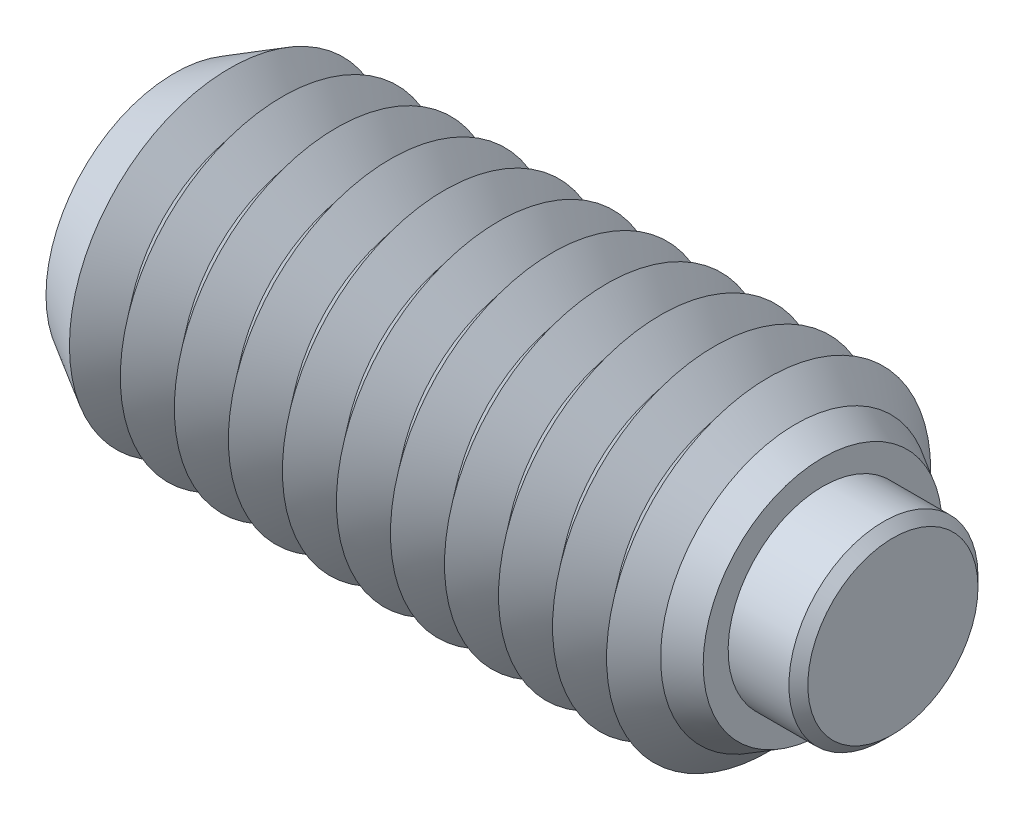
ISO-10303-21;
HEADER;
FILE_DESCRIPTION(('STEP AP214'),'2;1');
FILE_NAME('part.step','',(''),(''),'','','');
FILE_SCHEMA(('AUTOMOTIVE_DESIGN { 1 0 10303 214 1 1 1 1 }'));
ENDSEC;
DATA;
#1=APPLICATION_CONTEXT('core data for automotive mechanical design processes');
#2=APPLICATION_PROTOCOL_DEFINITION('international standard','automotive_design',2000,#1);
#3=PRODUCT_CONTEXT('',#1,'mechanical');
#4=PRODUCT('Part','Part','',(#3));
#5=PRODUCT_RELATED_PRODUCT_CATEGORY('part','',(#4));
#6=PRODUCT_DEFINITION_FORMATION('','',#4);
#7=PRODUCT_DEFINITION_CONTEXT('part definition',#1,'design');
#8=PRODUCT_DEFINITION('design','',#6,#7);
#9=PRODUCT_DEFINITION_SHAPE('','',#8);
#10=(LENGTH_UNIT() NAMED_UNIT(*) SI_UNIT(.MILLI.,.METRE.));
#11=(NAMED_UNIT(*) PLANE_ANGLE_UNIT() SI_UNIT($,.RADIAN.));
#12=(NAMED_UNIT(*) SI_UNIT($,.STERADIAN.) SOLID_ANGLE_UNIT());
#13=UNCERTAINTY_MEASURE_WITH_UNIT(LENGTH_MEASURE(1.E-05),#10,'distance_accuracy_value','');
#14=(GEOMETRIC_REPRESENTATION_CONTEXT(3) GLOBAL_UNCERTAINTY_ASSIGNED_CONTEXT((#13)) GLOBAL_UNIT_ASSIGNED_CONTEXT((#10,
#11,#12)) REPRESENTATION_CONTEXT('',''));
#15=CARTESIAN_POINT('',(0.,0.,0.));
#16=DIRECTION('',(0.,0.,1.));
#17=DIRECTION('',(1.,0.,0.));
#18=AXIS2_PLACEMENT_3D('',#15,#16,#17);
#19=CARTESIAN_POINT('',(1.8,0.,0.));
#20=DIRECTION('',(-1.,0.,0.));
#21=DIRECTION('',(0.,0.,1.));
#22=AXIS2_PLACEMENT_3D('',#19,#20,#21);
#23=CYLINDRICAL_SURFACE('',#22,1.75);
#24=CARTESIAN_POINT('',(1.625,0.,0.));
#25=DIRECTION('',(1.,0.,0.));
#26=DIRECTION('',(0.,0.,-1.));
#27=AXIS2_PLACEMENT_3D('',#24,#25,#26);
#28=CIRCLE('',#27,1.75);
#29=CARTESIAN_POINT('',(1.625,0.,-1.75));
#30=VERTEX_POINT('',#29);
#31=EDGE_CURVE('P0_E10',#30,#30,#28,.F.);
#32=ORIENTED_EDGE('',*,*,#31,.T.);
#33=EDGE_LOOP('',(#32));
#34=FACE_BOUND('',#33,.T.);
#35=CARTESIAN_POINT('',(-0.8,0.,0.));
#36=DIRECTION('',(1.,0.,0.));
#37=DIRECTION('',(0.,0.,-1.));
#38=AXIS2_PLACEMENT_3D('',#35,#36,#37);
#39=CIRCLE('',#38,1.75);
#40=CARTESIAN_POINT('',(-0.8,0.,-1.75));
#41=VERTEX_POINT('',#40);
#42=EDGE_CURVE('P0_E25',#41,#41,#39,.T.);
#43=ORIENTED_EDGE('',*,*,#42,.T.);
#44=EDGE_LOOP('',(#43));
#45=FACE_BOUND('',#44,.T.);
#46=ADVANCED_FACE('P0_F14',(#34,#45),#23,.T.);
#47=CARTESIAN_POINT('',(1.8,0.,0.));
#48=DIRECTION('',(1.,0.,0.));
#49=DIRECTION('',(0.,0.,-1.));
#50=AXIS2_PLACEMENT_3D('',#47,#48,#49);
#51=PLANE('',#50);
#52=CARTESIAN_POINT('',(1.8,0.,0.));
#53=DIRECTION('',(1.,0.,0.));
#54=DIRECTION('',(0.,0.,-1.));
#55=AXIS2_PLACEMENT_3D('',#52,#53,#54);
#56=CIRCLE('',#55,1.575);
#57=CARTESIAN_POINT('',(1.8,0.,-1.575));
#58=VERTEX_POINT('',#57);
#59=EDGE_CURVE('P0_E21',#58,#58,#56,.T.);
#60=ORIENTED_EDGE('',*,*,#59,.T.);
#61=EDGE_LOOP('',(#60));
#62=FACE_BOUND('',#61,.T.);
#63=ADVANCED_FACE('P0_F35',(#62),#51,.T.);
#64=CARTESIAN_POINT('',(-0.8,0.,0.));
#65=DIRECTION('',(1.,0.,0.));
#66=DIRECTION('',(0.,0.,-1.));
#67=AXIS2_PLACEMENT_3D('',#64,#65,#66);
#68=PLANE('',#67);
#69=ORIENTED_EDGE('',*,*,#42,.F.);
#70=EDGE_LOOP('',(#69));
#71=FACE_BOUND('',#70,.T.);
#72=ADVANCED_FACE('P0_F33',(#71),#68,.F.);
#73=CARTESIAN_POINT('',(1.8,0.,0.));
#74=DIRECTION('',(-1.,0.,0.));
#75=DIRECTION('',(0.,0.,1.));
#76=AXIS2_PLACEMENT_3D('',#73,#74,#75);
#77=CONICAL_SURFACE('',#76,1.575,0.785398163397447);
#78=ORIENTED_EDGE('',*,*,#31,.F.);
#79=EDGE_LOOP('',(#78));
#80=FACE_BOUND('',#79,.T.);
#81=ORIENTED_EDGE('',*,*,#59,.F.);
#82=EDGE_LOOP('',(#81));
#83=FACE_BOUND('',#82,.T.);
#84=ADVANCED_FACE('P0_F16',(#80,#83),#77,.T.);
#85=CLOSED_SHELL('',(#46,#63,#72,#84));
#86=MANIFOLD_SOLID_BREP('P0_B1',#85);
#87=CARTESIAN_POINT('',(-10.5,0.,0.));
#88=DIRECTION('',(-1.,0.,0.));
#89=DIRECTION('',(0.,0.,1.));
#90=AXIS2_PLACEMENT_3D('',#87,#88,#89);
#91=CONICAL_SURFACE('',#90,3.,0.895664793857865);
#92=CARTESIAN_POINT('',(-10.,0.,0.));
#93=DIRECTION('',(1.,0.,0.));
#94=DIRECTION('',(0.,0.,-1.));
#95=AXIS2_PLACEMENT_3D('',#92,#93,#94);
#96=CIRCLE('',#95,2.37550020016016);
#97=CARTESIAN_POINT('',(-10.,0.,-2.37550020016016));
#98=VERTEX_POINT('',#97);
#99=EDGE_CURVE('P1_E749',#98,#98,#96,.T.);
#100=ORIENTED_EDGE('',*,*,#99,.F.);
#101=EDGE_LOOP('',(#100));
#102=FACE_BOUND('',#101,.T.);
#103=CARTESIAN_POINT('',(-10.4741837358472,0.,0.));
#104=DIRECTION('',(1.,0.,0.));
#105=DIRECTION('',(0.,0.,-1.));
#106=AXIS2_PLACEMENT_3D('',#103,#104,#105);
#107=CIRCLE('',#106,2.96775549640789);
#108=CARTESIAN_POINT('',(-10.4741837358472,0.,-2.96775549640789));
#109=VERTEX_POINT('',#108);
#110=EDGE_CURVE('P1_E752',#109,#109,#107,.F.);
#111=ORIENTED_EDGE('',*,*,#110,.F.);
#112=EDGE_LOOP('',(#111));
#113=FACE_BOUND('',#112,.T.);
#114=ADVANCED_FACE('P1_F15',(#102,#113),#91,.T.);
#115=CARTESIAN_POINT('',(-0.999999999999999,0.,0.));
#116=DIRECTION('',(1.,0.,0.));
#117=DIRECTION('',(0.,0.,-1.));
#118=AXIS2_PLACEMENT_3D('',#115,#116,#117);
#119=CONICAL_SURFACE('',#118,2.37550020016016,0.895664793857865);
#120=CARTESIAN_POINT('',(-0.499999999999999,0.,0.));
#121=DIRECTION('',(1.,0.,0.));
#122=DIRECTION('',(0.,0.,-1.));
#123=AXIS2_PLACEMENT_3D('',#120,#121,#122);
#124=CIRCLE('',#123,3.);
#125=CARTESIAN_POINT('',(-0.499999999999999,0.,-3.));
#126=VERTEX_POINT('',#125);
#127=EDGE_CURVE('P1_E691',#126,#126,#124,.T.);
#128=ORIENTED_EDGE('',*,*,#127,.F.);
#129=EDGE_LOOP('',(#128));
#130=FACE_BOUND('',#129,.T.);
#131=CARTESIAN_POINT('',(-0.999999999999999,0.,0.));
#132=DIRECTION('',(1.,0.,0.));
#133=DIRECTION('',(0.,0.,-1.));
#134=AXIS2_PLACEMENT_3D('',#131,#132,#133);
#135=CIRCLE('',#134,2.37550020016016);
#136=CARTESIAN_POINT('',(-0.999999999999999,0.,-2.37550020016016));
#137=VERTEX_POINT('',#136);
#138=EDGE_CURVE('P1_E692',#137,#137,#135,.T.);
#139=ORIENTED_EDGE('',*,*,#138,.T.);
#140=EDGE_LOOP('',(#139));
#141=FACE_BOUND('',#140,.T.);
#142=ADVANCED_FACE('P1_F222',(#130,#141),#119,.T.);
#143=CARTESIAN_POINT('',(-1.5,0.,0.));
#144=DIRECTION('',(-1.,0.,0.));
#145=DIRECTION('',(0.,0.,1.));
#146=AXIS2_PLACEMENT_3D('',#143,#144,#145);
#147=CONICAL_SURFACE('',#146,3.,0.895664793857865);
#148=ORIENTED_EDGE('',*,*,#138,.F.);
#149=EDGE_LOOP('',(#148));
#150=FACE_BOUND('',#149,.T.);
#151=CARTESIAN_POINT('',(-1.5,0.,0.));
#152=DIRECTION('',(1.,0.,0.));
#153=DIRECTION('',(0.,0.,-1.));
#154=AXIS2_PLACEMENT_3D('',#151,#152,#153);
#155=CIRCLE('',#154,3.);
#156=CARTESIAN_POINT('',(-1.5,0.,-3.));
#157=VERTEX_POINT('',#156);
#158=EDGE_CURVE('P1_E696',#157,#157,#155,.T.);
#159=ORIENTED_EDGE('',*,*,#158,.T.);
#160=EDGE_LOOP('',(#159));
#161=FACE_BOUND('',#160,.T.);
#162=ADVANCED_FACE('P1_F227',(#150,#161),#147,.T.);
#163=CARTESIAN_POINT('',(-0.8,0.,0.));
#164=DIRECTION('',(1.,0.,0.));
#165=DIRECTION('',(0.,1.,0.));
#166=AXIS2_PLACEMENT_3D('',#163,#164,#165);
#167=PLANE('',#166);
#168=CARTESIAN_POINT('',(-0.8,0.,0.));
#169=DIRECTION('',(1.,0.,0.));
#170=DIRECTION('',(0.,1.,0.));
#171=AXIS2_PLACEMENT_3D('',#168,#169,#170);
#172=CIRCLE('',#171,1.75);
#173=CARTESIAN_POINT('',(-0.8,1.75,0.));
#174=VERTEX_POINT('',#173);
#175=EDGE_CURVE('P1_E374',#174,#174,#172,.T.);
#176=ORIENTED_EDGE('',*,*,#175,.T.);
#177=EDGE_LOOP('',(#176));
#178=FACE_BOUND('',#177,.T.);
#179=ADVANCED_FACE('P1_F301',(#178),#167,.T.);
#180=CARTESIAN_POINT('',(-0.8,0.,0.));
#181=DIRECTION('',(1.,0.,0.));
#182=DIRECTION('',(0.,1.,0.));
#183=AXIS2_PLACEMENT_3D('',#180,#181,#182);
#184=CYLINDRICAL_SURFACE('',#183,1.75);
#185=ORIENTED_EDGE('',*,*,#175,.F.);
#186=EDGE_LOOP('',(#185));
#187=FACE_BOUND('',#186,.T.);
#188=CARTESIAN_POINT('',(0.5,0.,0.));
#189=DIRECTION('',(1.,0.,0.));
#190=DIRECTION('',(0.,1.,0.));
#191=AXIS2_PLACEMENT_3D('',#188,#189,#190);
#192=CIRCLE('',#191,1.75);
#193=CARTESIAN_POINT('',(0.5,1.75,0.));
#194=VERTEX_POINT('',#193);
#195=EDGE_CURVE('P1_E377',#194,#194,#192,.T.);
#196=ORIENTED_EDGE('',*,*,#195,.T.);
#197=EDGE_LOOP('',(#196));
#198=FACE_BOUND('',#197,.T.);
#199=ADVANCED_FACE('P1_F209',(#187,#198),#184,.F.);
#200=CARTESIAN_POINT('',(0.5,2.21132486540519,0.));
#201=DIRECTION('',(1.,0.,0.));
#202=DIRECTION('',(0.,1.,0.));
#203=AXIS2_PLACEMENT_3D('',#200,#201,#202);
#204=PLANE('',#203);
#205=ORIENTED_EDGE('',*,*,#195,.F.);
#206=EDGE_LOOP('',(#205));
#207=FACE_BOUND('',#206,.T.);
#208=CARTESIAN_POINT('',(0.5,0.,0.));
#209=DIRECTION('',(1.,0.,0.));
#210=DIRECTION('',(0.,1.,0.));
#211=AXIS2_PLACEMENT_3D('',#208,#209,#210);
#212=CIRCLE('',#211,2.21132486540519);
#213=CARTESIAN_POINT('',(0.5,2.21132486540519,0.));
#214=VERTEX_POINT('',#213);
#215=EDGE_CURVE('P1_E121',#214,#214,#212,.T.);
#216=ORIENTED_EDGE('',*,*,#215,.T.);
#217=EDGE_LOOP('',(#216));
#218=FACE_BOUND('',#217,.T.);
#219=ADVANCED_FACE('P1_F206',(#207,#218),#204,.T.);
#220=CARTESIAN_POINT('',(0.5,0.,0.));
#221=DIRECTION('',(-1.,0.,0.));
#222=DIRECTION('',(0.,-1.,0.));
#223=AXIS2_PLACEMENT_3D('',#220,#221,#222);
#224=CONICAL_SURFACE('',#223,2.21132486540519,0.523598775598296);
#225=CARTESIAN_POINT('',(0.,0.,0.));
#226=DIRECTION('',(1.,0.,0.));
#227=DIRECTION('',(0.,0.,-1.));
#228=AXIS2_PLACEMENT_3D('',#225,#226,#227);
#229=CIRCLE('',#228,2.5);
#230=CARTESIAN_POINT('',(0.,0.,-2.5));
#231=VERTEX_POINT('',#230);
#232=EDGE_CURVE('P1_E365',#231,#231,#229,.T.);
#233=ORIENTED_EDGE('',*,*,#232,.T.);
#234=EDGE_LOOP('',(#233));
#235=FACE_BOUND('',#234,.T.);
#236=ORIENTED_EDGE('',*,*,#215,.F.);
#237=EDGE_LOOP('',(#236));
#238=FACE_BOUND('',#237,.T.);
#239=ADVANCED_FACE('P1_F203',(#235,#238),#224,.T.);
#240=CARTESIAN_POINT('',(0.,0.,0.));
#241=DIRECTION('',(-1.,0.,0.));
#242=DIRECTION('',(0.,0.,1.));
#243=AXIS2_PLACEMENT_3D('',#240,#241,#242);
#244=CONICAL_SURFACE('',#243,2.5,0.785398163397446);
#245=ORIENTED_EDGE('',*,*,#127,.T.);
#246=EDGE_LOOP('',(#245));
#247=FACE_BOUND('',#246,.T.);
#248=ORIENTED_EDGE('',*,*,#232,.F.);
#249=EDGE_LOOP('',(#248));
#250=FACE_BOUND('',#249,.T.);
#251=ADVANCED_FACE('P1_F17',(#247,#250),#244,.T.);
#252=CARTESIAN_POINT('',(-2.,0.,0.));
#253=DIRECTION('',(1.,0.,0.));
#254=DIRECTION('',(0.,0.,-1.));
#255=AXIS2_PLACEMENT_3D('',#252,#253,#254);
#256=CONICAL_SURFACE('',#255,2.37550020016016,0.895664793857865);
#257=ORIENTED_EDGE('',*,*,#158,.F.);
#258=EDGE_LOOP('',(#257));
#259=FACE_BOUND('',#258,.T.);
#260=CARTESIAN_POINT('',(-2.,0.,0.));
#261=DIRECTION('',(1.,0.,0.));
#262=DIRECTION('',(0.,0.,-1.));
#263=AXIS2_PLACEMENT_3D('',#260,#261,#262);
#264=CIRCLE('',#263,2.37550020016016);
#265=CARTESIAN_POINT('',(-2.,0.,-2.37550020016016));
#266=VERTEX_POINT('',#265);
#267=EDGE_CURVE('P1_E701',#266,#266,#264,.T.);
#268=ORIENTED_EDGE('',*,*,#267,.T.);
#269=EDGE_LOOP('',(#268));
#270=FACE_BOUND('',#269,.T.);
#271=ADVANCED_FACE('P1_F295',(#259,#270),#256,.T.);
#272=CARTESIAN_POINT('',(-2.5,0.,0.));
#273=DIRECTION('',(-1.,0.,0.));
#274=DIRECTION('',(0.,0.,1.));
#275=AXIS2_PLACEMENT_3D('',#272,#273,#274);
#276=CONICAL_SURFACE('',#275,3.,0.895664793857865);
#277=ORIENTED_EDGE('',*,*,#267,.F.);
#278=EDGE_LOOP('',(#277));
#279=FACE_BOUND('',#278,.T.);
#280=CARTESIAN_POINT('',(-2.5,0.,0.));
#281=DIRECTION('',(1.,0.,0.));
#282=DIRECTION('',(0.,0.,-1.));
#283=AXIS2_PLACEMENT_3D('',#280,#281,#282);
#284=CIRCLE('',#283,3.);
#285=CARTESIAN_POINT('',(-2.5,0.,-3.));
#286=VERTEX_POINT('',#285);
#287=EDGE_CURVE('P1_E704',#286,#286,#284,.T.);
#288=ORIENTED_EDGE('',*,*,#287,.T.);
#289=EDGE_LOOP('',(#288));
#290=FACE_BOUND('',#289,.T.);
#291=ADVANCED_FACE('P1_F291',(#279,#290),#276,.T.);
#292=CARTESIAN_POINT('',(-3.,0.,0.));
#293=DIRECTION('',(1.,0.,0.));
#294=DIRECTION('',(0.,0.,-1.));
#295=AXIS2_PLACEMENT_3D('',#292,#293,#294);
#296=CONICAL_SURFACE('',#295,2.37550020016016,0.895664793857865);
#297=ORIENTED_EDGE('',*,*,#287,.F.);
#298=EDGE_LOOP('',(#297));
#299=FACE_BOUND('',#298,.T.);
#300=CARTESIAN_POINT('',(-3.,0.,0.));
#301=DIRECTION('',(1.,0.,0.));
#302=DIRECTION('',(0.,0.,-1.));
#303=AXIS2_PLACEMENT_3D('',#300,#301,#302);
#304=CIRCLE('',#303,2.37550020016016);
#305=CARTESIAN_POINT('',(-3.,0.,-2.37550020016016));
#306=VERTEX_POINT('',#305);
#307=EDGE_CURVE('P1_E707',#306,#306,#304,.T.);
#308=ORIENTED_EDGE('',*,*,#307,.T.);
#309=EDGE_LOOP('',(#308));
#310=FACE_BOUND('',#309,.T.);
#311=ADVANCED_FACE('P1_F287',(#299,#310),#296,.T.);
#312=CARTESIAN_POINT('',(-3.5,0.,0.));
#313=DIRECTION('',(-1.,0.,0.));
#314=DIRECTION('',(0.,0.,1.));
#315=AXIS2_PLACEMENT_3D('',#312,#313,#314);
#316=CONICAL_SURFACE('',#315,3.,0.895664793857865);
#317=ORIENTED_EDGE('',*,*,#307,.F.);
#318=EDGE_LOOP('',(#317));
#319=FACE_BOUND('',#318,.T.);
#320=CARTESIAN_POINT('',(-3.5,0.,0.));
#321=DIRECTION('',(1.,0.,0.));
#322=DIRECTION('',(0.,0.,-1.));
#323=AXIS2_PLACEMENT_3D('',#320,#321,#322);
#324=CIRCLE('',#323,3.);
#325=CARTESIAN_POINT('',(-3.5,0.,-3.));
#326=VERTEX_POINT('',#325);
#327=EDGE_CURVE('P1_E710',#326,#326,#324,.T.);
#328=ORIENTED_EDGE('',*,*,#327,.T.);
#329=EDGE_LOOP('',(#328));
#330=FACE_BOUND('',#329,.T.);
#331=ADVANCED_FACE('P1_F283',(#319,#330),#316,.T.);
#332=CARTESIAN_POINT('',(-4.,0.,0.));
#333=DIRECTION('',(1.,0.,0.));
#334=DIRECTION('',(0.,0.,-1.));
#335=AXIS2_PLACEMENT_3D('',#332,#333,#334);
#336=CONICAL_SURFACE('',#335,2.37550020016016,0.895664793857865);
#337=ORIENTED_EDGE('',*,*,#327,.F.);
#338=EDGE_LOOP('',(#337));
#339=FACE_BOUND('',#338,.T.);
#340=CARTESIAN_POINT('',(-4.,0.,0.));
#341=DIRECTION('',(1.,0.,0.));
#342=DIRECTION('',(0.,0.,-1.));
#343=AXIS2_PLACEMENT_3D('',#340,#341,#342);
#344=CIRCLE('',#343,2.37550020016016);
#345=CARTESIAN_POINT('',(-4.,0.,-2.37550020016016));
#346=VERTEX_POINT('',#345);
#347=EDGE_CURVE('P1_E713',#346,#346,#344,.T.);
#348=ORIENTED_EDGE('',*,*,#347,.T.);
#349=EDGE_LOOP('',(#348));
#350=FACE_BOUND('',#349,.T.);
#351=ADVANCED_FACE('P1_F279',(#339,#350),#336,.T.);
#352=CARTESIAN_POINT('',(-4.5,0.,0.));
#353=DIRECTION('',(-1.,0.,0.));
#354=DIRECTION('',(0.,0.,1.));
#355=AXIS2_PLACEMENT_3D('',#352,#353,#354);
#356=CONICAL_SURFACE('',#355,3.,0.895664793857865);
#357=ORIENTED_EDGE('',*,*,#347,.F.);
#358=EDGE_LOOP('',(#357));
#359=FACE_BOUND('',#358,.T.);
#360=CARTESIAN_POINT('',(-4.5,0.,0.));
#361=DIRECTION('',(1.,0.,0.));
#362=DIRECTION('',(0.,0.,-1.));
#363=AXIS2_PLACEMENT_3D('',#360,#361,#362);
#364=CIRCLE('',#363,3.);
#365=CARTESIAN_POINT('',(-4.5,0.,-3.));
#366=VERTEX_POINT('',#365);
#367=EDGE_CURVE('P1_E716',#366,#366,#364,.T.);
#368=ORIENTED_EDGE('',*,*,#367,.T.);
#369=EDGE_LOOP('',(#368));
#370=FACE_BOUND('',#369,.T.);
#371=ADVANCED_FACE('P1_F275',(#359,#370),#356,.T.);
#372=CARTESIAN_POINT('',(-5.,0.,0.));
#373=DIRECTION('',(1.,0.,0.));
#374=DIRECTION('',(0.,0.,-1.));
#375=AXIS2_PLACEMENT_3D('',#372,#373,#374);
#376=CONICAL_SURFACE('',#375,2.37550020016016,0.895664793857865);
#377=ORIENTED_EDGE('',*,*,#367,.F.);
#378=EDGE_LOOP('',(#377));
#379=FACE_BOUND('',#378,.T.);
#380=CARTESIAN_POINT('',(-5.,0.,0.));
#381=DIRECTION('',(1.,0.,0.));
#382=DIRECTION('',(0.,0.,-1.));
#383=AXIS2_PLACEMENT_3D('',#380,#381,#382);
#384=CIRCLE('',#383,2.37550020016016);
#385=CARTESIAN_POINT('',(-5.,0.,-2.37550020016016));
#386=VERTEX_POINT('',#385);
#387=EDGE_CURVE('P1_E719',#386,#386,#384,.T.);
#388=ORIENTED_EDGE('',*,*,#387,.T.);
#389=EDGE_LOOP('',(#388));
#390=FACE_BOUND('',#389,.T.);
#391=ADVANCED_FACE('P1_F271',(#379,#390),#376,.T.);
#392=CARTESIAN_POINT('',(-5.5,0.,0.));
#393=DIRECTION('',(-1.,0.,0.));
#394=DIRECTION('',(0.,0.,1.));
#395=AXIS2_PLACEMENT_3D('',#392,#393,#394);
#396=CONICAL_SURFACE('',#395,3.,0.895664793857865);
#397=ORIENTED_EDGE('',*,*,#387,.F.);
#398=EDGE_LOOP('',(#397));
#399=FACE_BOUND('',#398,.T.);
#400=CARTESIAN_POINT('',(-5.5,0.,0.));
#401=DIRECTION('',(1.,0.,0.));
#402=DIRECTION('',(0.,0.,-1.));
#403=AXIS2_PLACEMENT_3D('',#400,#401,#402);
#404=CIRCLE('',#403,3.);
#405=CARTESIAN_POINT('',(-5.5,0.,-3.));
#406=VERTEX_POINT('',#405);
#407=EDGE_CURVE('P1_E722',#406,#406,#404,.T.);
#408=ORIENTED_EDGE('',*,*,#407,.T.);
#409=EDGE_LOOP('',(#408));
#410=FACE_BOUND('',#409,.T.);
#411=ADVANCED_FACE('P1_F267',(#399,#410),#396,.T.);
#412=CARTESIAN_POINT('',(-6.,0.,0.));
#413=DIRECTION('',(1.,0.,0.));
#414=DIRECTION('',(0.,0.,-1.));
#415=AXIS2_PLACEMENT_3D('',#412,#413,#414);
#416=CONICAL_SURFACE('',#415,2.37550020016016,0.895664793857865);
#417=ORIENTED_EDGE('',*,*,#407,.F.);
#418=EDGE_LOOP('',(#417));
#419=FACE_BOUND('',#418,.T.);
#420=CARTESIAN_POINT('',(-6.,0.,0.));
#421=DIRECTION('',(1.,0.,0.));
#422=DIRECTION('',(0.,0.,-1.));
#423=AXIS2_PLACEMENT_3D('',#420,#421,#422);
#424=CIRCLE('',#423,2.37550020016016);
#425=CARTESIAN_POINT('',(-6.,0.,-2.37550020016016));
#426=VERTEX_POINT('',#425);
#427=EDGE_CURVE('P1_E725',#426,#426,#424,.T.);
#428=ORIENTED_EDGE('',*,*,#427,.T.);
#429=EDGE_LOOP('',(#428));
#430=FACE_BOUND('',#429,.T.);
#431=ADVANCED_FACE('P1_F263',(#419,#430),#416,.T.);
#432=CARTESIAN_POINT('',(-6.5,0.,0.));
#433=DIRECTION('',(-1.,0.,0.));
#434=DIRECTION('',(0.,0.,1.));
#435=AXIS2_PLACEMENT_3D('',#432,#433,#434);
#436=CONICAL_SURFACE('',#435,3.,0.895664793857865);
#437=ORIENTED_EDGE('',*,*,#427,.F.);
#438=EDGE_LOOP('',(#437));
#439=FACE_BOUND('',#438,.T.);
#440=CARTESIAN_POINT('',(-6.5,0.,0.));
#441=DIRECTION('',(1.,0.,0.));
#442=DIRECTION('',(0.,0.,-1.));
#443=AXIS2_PLACEMENT_3D('',#440,#441,#442);
#444=CIRCLE('',#443,3.);
#445=CARTESIAN_POINT('',(-6.5,0.,-3.));
#446=VERTEX_POINT('',#445);
#447=EDGE_CURVE('P1_E728',#446,#446,#444,.T.);
#448=ORIENTED_EDGE('',*,*,#447,.T.);
#449=EDGE_LOOP('',(#448));
#450=FACE_BOUND('',#449,.T.);
#451=ADVANCED_FACE('P1_F259',(#439,#450),#436,.T.);
#452=CARTESIAN_POINT('',(-7.,0.,0.));
#453=DIRECTION('',(1.,0.,0.));
#454=DIRECTION('',(0.,0.,-1.));
#455=AXIS2_PLACEMENT_3D('',#452,#453,#454);
#456=CONICAL_SURFACE('',#455,2.37550020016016,0.895664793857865);
#457=ORIENTED_EDGE('',*,*,#447,.F.);
#458=EDGE_LOOP('',(#457));
#459=FACE_BOUND('',#458,.T.);
#460=CARTESIAN_POINT('',(-7.,0.,0.));
#461=DIRECTION('',(1.,0.,0.));
#462=DIRECTION('',(0.,0.,-1.));
#463=AXIS2_PLACEMENT_3D('',#460,#461,#462);
#464=CIRCLE('',#463,2.37550020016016);
#465=CARTESIAN_POINT('',(-7.,0.,-2.37550020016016));
#466=VERTEX_POINT('',#465);
#467=EDGE_CURVE('P1_E731',#466,#466,#464,.T.);
#468=ORIENTED_EDGE('',*,*,#467,.T.);
#469=EDGE_LOOP('',(#468));
#470=FACE_BOUND('',#469,.T.);
#471=ADVANCED_FACE('P1_F255',(#459,#470),#456,.T.);
#472=CARTESIAN_POINT('',(-7.5,0.,0.));
#473=DIRECTION('',(-1.,0.,0.));
#474=DIRECTION('',(0.,0.,1.));
#475=AXIS2_PLACEMENT_3D('',#472,#473,#474);
#476=CONICAL_SURFACE('',#475,3.,0.895664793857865);
#477=ORIENTED_EDGE('',*,*,#467,.F.);
#478=EDGE_LOOP('',(#477));
#479=FACE_BOUND('',#478,.T.);
#480=CARTESIAN_POINT('',(-7.5,0.,0.));
#481=DIRECTION('',(1.,0.,0.));
#482=DIRECTION('',(0.,0.,-1.));
#483=AXIS2_PLACEMENT_3D('',#480,#481,#482);
#484=CIRCLE('',#483,3.);
#485=CARTESIAN_POINT('',(-7.5,0.,-3.));
#486=VERTEX_POINT('',#485);
#487=EDGE_CURVE('P1_E734',#486,#486,#484,.T.);
#488=ORIENTED_EDGE('',*,*,#487,.T.);
#489=EDGE_LOOP('',(#488));
#490=FACE_BOUND('',#489,.T.);
#491=ADVANCED_FACE('P1_F251',(#479,#490),#476,.T.);
#492=CARTESIAN_POINT('',(-8.,0.,0.));
#493=DIRECTION('',(1.,0.,0.));
#494=DIRECTION('',(0.,0.,-1.));
#495=AXIS2_PLACEMENT_3D('',#492,#493,#494);
#496=CONICAL_SURFACE('',#495,2.37550020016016,0.895664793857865);
#497=ORIENTED_EDGE('',*,*,#487,.F.);
#498=EDGE_LOOP('',(#497));
#499=FACE_BOUND('',#498,.T.);
#500=CARTESIAN_POINT('',(-8.,0.,0.));
#501=DIRECTION('',(1.,0.,0.));
#502=DIRECTION('',(0.,0.,-1.));
#503=AXIS2_PLACEMENT_3D('',#500,#501,#502);
#504=CIRCLE('',#503,2.37550020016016);
#505=CARTESIAN_POINT('',(-8.,0.,-2.37550020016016));
#506=VERTEX_POINT('',#505);
#507=EDGE_CURVE('P1_E737',#506,#506,#504,.T.);
#508=ORIENTED_EDGE('',*,*,#507,.T.);
#509=EDGE_LOOP('',(#508));
#510=FACE_BOUND('',#509,.T.);
#511=ADVANCED_FACE('P1_F247',(#499,#510),#496,.T.);
#512=CARTESIAN_POINT('',(-8.5,0.,0.));
#513=DIRECTION('',(-1.,0.,0.));
#514=DIRECTION('',(0.,0.,1.));
#515=AXIS2_PLACEMENT_3D('',#512,#513,#514);
#516=CONICAL_SURFACE('',#515,3.,0.895664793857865);
#517=ORIENTED_EDGE('',*,*,#507,.F.);
#518=EDGE_LOOP('',(#517));
#519=FACE_BOUND('',#518,.T.);
#520=CARTESIAN_POINT('',(-8.5,0.,0.));
#521=DIRECTION('',(1.,0.,0.));
#522=DIRECTION('',(0.,0.,-1.));
#523=AXIS2_PLACEMENT_3D('',#520,#521,#522);
#524=CIRCLE('',#523,3.);
#525=CARTESIAN_POINT('',(-8.5,0.,-3.));
#526=VERTEX_POINT('',#525);
#527=EDGE_CURVE('P1_E740',#526,#526,#524,.T.);
#528=ORIENTED_EDGE('',*,*,#527,.T.);
#529=EDGE_LOOP('',(#528));
#530=FACE_BOUND('',#529,.T.);
#531=ADVANCED_FACE('P1_F243',(#519,#530),#516,.T.);
#532=CARTESIAN_POINT('',(-9.,0.,0.));
#533=DIRECTION('',(1.,0.,0.));
#534=DIRECTION('',(0.,0.,-1.));
#535=AXIS2_PLACEMENT_3D('',#532,#533,#534);
#536=CONICAL_SURFACE('',#535,2.37550020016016,0.895664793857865);
#537=ORIENTED_EDGE('',*,*,#527,.F.);
#538=EDGE_LOOP('',(#537));
#539=FACE_BOUND('',#538,.T.);
#540=CARTESIAN_POINT('',(-9.,0.,0.));
#541=DIRECTION('',(1.,0.,0.));
#542=DIRECTION('',(0.,0.,-1.));
#543=AXIS2_PLACEMENT_3D('',#540,#541,#542);
#544=CIRCLE('',#543,2.37550020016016);
#545=CARTESIAN_POINT('',(-9.,0.,-2.37550020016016));
#546=VERTEX_POINT('',#545);
#547=EDGE_CURVE('P1_E743',#546,#546,#544,.T.);
#548=ORIENTED_EDGE('',*,*,#547,.T.);
#549=EDGE_LOOP('',(#548));
#550=FACE_BOUND('',#549,.T.);
#551=ADVANCED_FACE('P1_F239',(#539,#550),#536,.T.);
#552=CARTESIAN_POINT('',(-9.5,0.,0.));
#553=DIRECTION('',(-1.,0.,0.));
#554=DIRECTION('',(0.,0.,1.));
#555=AXIS2_PLACEMENT_3D('',#552,#553,#554);
#556=CONICAL_SURFACE('',#555,3.,0.895664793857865);
#557=ORIENTED_EDGE('',*,*,#547,.F.);
#558=EDGE_LOOP('',(#557));
#559=FACE_BOUND('',#558,.T.);
#560=CARTESIAN_POINT('',(-9.5,0.,0.));
#561=DIRECTION('',(1.,0.,0.));
#562=DIRECTION('',(0.,0.,-1.));
#563=AXIS2_PLACEMENT_3D('',#560,#561,#562);
#564=CIRCLE('',#563,3.);
#565=CARTESIAN_POINT('',(-9.5,0.,-3.));
#566=VERTEX_POINT('',#565);
#567=EDGE_CURVE('P1_E746',#566,#566,#564,.T.);
#568=ORIENTED_EDGE('',*,*,#567,.T.);
#569=EDGE_LOOP('',(#568));
#570=FACE_BOUND('',#569,.T.);
#571=ADVANCED_FACE('P1_F235',(#559,#570),#556,.T.);
#572=CARTESIAN_POINT('',(-10.,0.,0.));
#573=DIRECTION('',(1.,0.,0.));
#574=DIRECTION('',(0.,0.,-1.));
#575=AXIS2_PLACEMENT_3D('',#572,#573,#574);
#576=CONICAL_SURFACE('',#575,2.37550020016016,0.895664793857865);
#577=ORIENTED_EDGE('',*,*,#567,.F.);
#578=EDGE_LOOP('',(#577));
#579=FACE_BOUND('',#578,.T.);
#580=ORIENTED_EDGE('',*,*,#99,.T.);
#581=EDGE_LOOP('',(#580));
#582=FACE_BOUND('',#581,.T.);
#583=ADVANCED_FACE('P1_F219',(#579,#582),#576,.T.);
#584=CARTESIAN_POINT('',(-11.5,0.,0.));
#585=DIRECTION('',(1.,0.,0.));
#586=DIRECTION('',(0.,0.,1.));
#587=AXIS2_PLACEMENT_3D('',#584,#585,#586);
#588=CONICAL_SURFACE('',#587,2.37550020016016,0.5235987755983);
#589=CARTESIAN_POINT('',(-11.5,0.,0.));
#590=DIRECTION('',(-1.,0.,0.));
#591=DIRECTION('',(0.,0.,1.));
#592=AXIS2_PLACEMENT_3D('',#589,#590,#591);
#593=CIRCLE('',#592,2.37550020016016);
#594=CARTESIAN_POINT('',(-11.5,0.,2.37550020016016));
#595=VERTEX_POINT('',#594);
#596=EDGE_CURVE('P1_E754',#595,#595,#593,.T.);
#597=ORIENTED_EDGE('',*,*,#596,.F.);
#598=EDGE_LOOP('',(#597));
#599=FACE_BOUND('',#598,.T.);
#600=ORIENTED_EDGE('',*,*,#110,.T.);
#601=EDGE_LOOP('',(#600));
#602=FACE_BOUND('',#601,.T.);
#603=ADVANCED_FACE('P1_F159',(#599,#602),#588,.T.);
#604=CARTESIAN_POINT('',(-11.5,0.,0.));
#605=DIRECTION('',(1.,0.,0.));
#606=DIRECTION('',(0.,0.,-1.));
#607=AXIS2_PLACEMENT_3D('',#604,#605,#606);
#608=PLANE('',#607);
#609=CARTESIAN_POINT('',(-11.5,0.,0.));
#610=DIRECTION('',(1.,0.,0.));
#611=DIRECTION('',(0.,0.,-1.));
#612=AXIS2_PLACEMENT_3D('',#609,#610,#611);
#613=CIRCLE('',#612,1.73205080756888);
#614=CARTESIAN_POINT('',(-11.5,-1.5,-0.866025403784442));
#615=VERTEX_POINT('',#614);
#616=CARTESIAN_POINT('',(-11.5,0.,-1.73205080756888));
#617=VERTEX_POINT('',#616);
#618=EDGE_CURVE('P1_E19',#615,#617,#613,.T.);
#619=ORIENTED_EDGE('',*,*,#618,.T.);
#620=CARTESIAN_POINT('',(-11.5,1.5,-0.866025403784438));
#621=VERTEX_POINT('',#620);
#622=EDGE_CURVE('P1_E10',#617,#621,#613,.T.);
#623=ORIENTED_EDGE('',*,*,#622,.T.);
#624=CARTESIAN_POINT('',(-11.5,1.5,0.866025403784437));
#625=VERTEX_POINT('',#624);
#626=EDGE_CURVE('P1_E24',#621,#625,#613,.T.);
#627=ORIENTED_EDGE('',*,*,#626,.T.);
#628=CARTESIAN_POINT('',(-11.5,0.,0.));
#629=DIRECTION('',(-1.,0.,0.));
#630=DIRECTION('',(0.,0.,1.));
#631=AXIS2_PLACEMENT_3D('',#628,#629,#630);
#632=CIRCLE('',#631,1.73205080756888);
#633=CARTESIAN_POINT('',(-11.5,0.,1.73205080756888));
#634=VERTEX_POINT('',#633);
#635=EDGE_CURVE('P1_E92',#634,#625,#632,.T.);
#636=ORIENTED_EDGE('',*,*,#635,.F.);
#637=CARTESIAN_POINT('',(-11.5,-1.5,0.86602540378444));
#638=VERTEX_POINT('',#637);
#639=EDGE_CURVE('P1_E101',#634,#638,#613,.T.);
#640=ORIENTED_EDGE('',*,*,#639,.T.);
#641=EDGE_CURVE('P1_E107',#638,#615,#613,.T.);
#642=ORIENTED_EDGE('',*,*,#641,.T.);
#643=EDGE_LOOP('',(#619,#623,#627,#636,#640,#642));
#644=FACE_BOUND('',#643,.T.);
#645=ORIENTED_EDGE('',*,*,#596,.T.);
#646=EDGE_LOOP('',(#645));
#647=FACE_BOUND('',#646,.T.);
#648=ADVANCED_FACE('P1_F108',(#644,#647),#608,.F.);
#649=CARTESIAN_POINT('',(-11.5,0.,0.));
#650=DIRECTION('',(-1.,0.,0.));
#651=DIRECTION('',(0.,0.,1.));
#652=AXIS2_PLACEMENT_3D('',#649,#650,#651);
#653=CONICAL_SURFACE('',#652,1.73205080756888,1.0471975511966);
#654=ORIENTED_EDGE('',*,*,#618,.F.);
#655=CARTESIAN_POINT('',(-11.5000666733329,0.000199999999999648,-1.73216627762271));
#656=CARTESIAN_POINT('',(-11.4780828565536,-0.0657192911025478,-1.69410775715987));
#657=CARTESIAN_POINT('',(-11.4580888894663,-0.132207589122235,-1.65572072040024));
#658=CARTESIAN_POINT('',(-11.4231881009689,-0.26633566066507,-1.5782818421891));
#659=CARTESIAN_POINT('',(-11.4082936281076,-0.333977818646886,-1.53922862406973));
#660=CARTESIAN_POINT('',(-11.3851066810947,-0.468423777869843,-1.4616062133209));
#661=CARTESIAN_POINT('',(-11.3766599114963,-0.535206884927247,-1.42304896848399));
#662=CARTESIAN_POINT('',(-11.3665735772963,-0.66908756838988,-1.34575291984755));
#663=CARTESIAN_POINT('',(-11.3649256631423,-0.736184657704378,-1.30701439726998));
#664=CARTESIAN_POINT('',(-11.3683416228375,-0.861574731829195,-1.23462040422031));
#665=CARTESIAN_POINT('',(-11.3725667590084,-0.919886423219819,-1.20095413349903));
#666=CARTESIAN_POINT('',(-11.3859617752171,-1.03612987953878,-1.13384094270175));
#667=CARTESIAN_POINT('',(-11.3951362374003,-1.09406124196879,-1.10039425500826));
#668=CARTESIAN_POINT('',(-11.4180731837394,-1.21054465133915,-1.03314252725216));
#669=CARTESIAN_POINT('',(-11.4319329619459,-1.26908194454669,-0.99934600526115));
#670=CARTESIAN_POINT('',(-11.4633897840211,-1.38528312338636,-0.932257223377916));
#671=CARTESIAN_POINT('',(-11.4809794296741,-1.44294849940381,-0.89896410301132));
#672=CARTESIAN_POINT('',(-11.5000666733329,-1.5002,-0.8659099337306));
#673=B_SPLINE_CURVE_WITH_KNOTS('',3,(#655,#656,#657,#658,#659,#660,#661,#662,#663,#664,#665,
#666,#667,#668,#669,#670,#671,#672),.UNSPECIFIED.,.F.,.F.,(4,2,2,2,2,2,2,2,4),(0.,
0.237777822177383,0.476127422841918,0.708577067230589,0.940741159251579,1.1429435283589,
1.34533342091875,1.55221450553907,1.75868901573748),.UNSPECIFIED.);
#674=EDGE_CURVE('P1_E130',#617,#615,#673,.T.);
#675=ORIENTED_EDGE('',*,*,#674,.F.);
#676=EDGE_LOOP('',(#654,#675));
#677=FACE_BOUND('',#676,.T.);
#678=ADVANCED_FACE('P1_F158',(#677),#653,.F.);
#679=ORIENTED_EDGE('',*,*,#641,.F.);
#680=CARTESIAN_POINT('',(-12.0577529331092,-1.5,-2.2427176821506));
#681=CARTESIAN_POINT('',(-12.0266762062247,-1.5,-2.17794242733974));
#682=CARTESIAN_POINT('',(-11.995922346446,-1.5,-2.11300950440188));
#683=CARTESIAN_POINT('',(-11.9352433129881,-1.5,-1.98274395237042));
#684=CARTESIAN_POINT('',(-11.9053182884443,-1.5,-1.91741125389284));
#685=CARTESIAN_POINT('',(-11.846312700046,-1.5,-1.78588718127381));
#686=CARTESIAN_POINT('',(-11.8172383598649,-1.5,-1.71969300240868));
#687=CARTESIAN_POINT('',(-11.7603940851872,-1.5,-1.58675026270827));
#688=CARTESIAN_POINT('',(-11.7326240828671,-1.5,-1.52000173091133));
#689=CARTESIAN_POINT('',(-11.6780255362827,-1.5,-1.38408099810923));
#690=CARTESIAN_POINT('',(-11.6512405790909,-1.5,-1.31489105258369));
#691=CARTESIAN_POINT('',(-11.5999065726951,-1.5,-1.17568930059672));
#692=CARTESIAN_POINT('',(-11.5753578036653,-1.5,-1.10567739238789));
#693=CARTESIAN_POINT('',(-11.5061010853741,-1.5,-0.89452263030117));
#694=CARTESIAN_POINT('',(-11.4656202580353,-1.5,-0.751874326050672));
#695=CARTESIAN_POINT('',(-11.4186644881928,-1.5,-0.535047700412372));
#696=CARTESIAN_POINT('',(-11.4053128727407,-1.5,-0.46236564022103));
#697=CARTESIAN_POINT('',(-11.3841134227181,-1.5,-0.316183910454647));
#698=CARTESIAN_POINT('',(-11.3762652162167,-1.5,-0.242684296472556));
#699=CARTESIAN_POINT('',(-11.3667985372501,-1.5,-0.0961589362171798));
#700=CARTESIAN_POINT('',(-11.3651065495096,-1.5,-0.0231380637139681));
#701=CARTESIAN_POINT('',(-11.3678994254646,-1.5,0.122783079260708));
#702=CARTESIAN_POINT('',(-11.3723846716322,-1.5,0.195683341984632));
#703=CARTESIAN_POINT('',(-11.3906776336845,-1.5,0.375553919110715));
#704=CARTESIAN_POINT('',(-11.4079134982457,-1.5,0.482175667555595));
#705=CARTESIAN_POINT('',(-11.4523598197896,-1.5,0.693345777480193));
#706=CARTESIAN_POINT('',(-11.4795822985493,-1.5,0.797891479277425));
#707=CARTESIAN_POINT('',(-11.5260849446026,-1.5,0.954251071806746));
#708=CARTESIAN_POINT('',(-11.5427475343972,-1.5,1.00687320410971));
#709=CARTESIAN_POINT('',(-11.5776140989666,-1.5,1.11156970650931));
#710=CARTESIAN_POINT('',(-11.595817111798,-1.5,1.16364439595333));
#711=CARTESIAN_POINT('',(-11.6335001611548,-1.5,1.26731560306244));
#712=CARTESIAN_POINT('',(-11.6529799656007,-1.5,1.31891220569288));
#713=CARTESIAN_POINT('',(-11.6930058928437,-1.5,1.42169884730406));
#714=CARTESIAN_POINT('',(-11.7135521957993,-1.5,1.47288881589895));
#715=CARTESIAN_POINT('',(-11.7673136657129,-1.5,1.60355339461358));
#716=CARTESIAN_POINT('',(-11.8011631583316,-1.5,1.68276673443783));
#717=CARTESIAN_POINT('',(-11.8704938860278,-1.5,1.84047808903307));
#718=CARTESIAN_POINT('',(-11.905975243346,-1.5,1.91897604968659));
#719=CARTESIAN_POINT('',(-12.0142918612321,-1.5,2.15363522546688));
#720=CARTESIAN_POINT('',(-12.0889885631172,-1.5,2.3089355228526));
#721=CARTESIAN_POINT('',(-12.2415147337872,-1.5,2.61820933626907));
#722=CARTESIAN_POINT('',(-12.3193479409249,-1.5,2.77218098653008));
#723=CARTESIAN_POINT('',(-12.4770156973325,-1.5,3.07906936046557));
#724=CARTESIAN_POINT('',(-12.5568499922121,-1.5,3.23198621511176));
#725=CARTESIAN_POINT('',(-12.7102968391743,-1.5,3.52269097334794));
#726=CARTESIAN_POINT('',(-12.7837854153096,-1.5,3.66054454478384));
#727=CARTESIAN_POINT('',(-12.9315998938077,-1.5,3.93580825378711));
#728=CARTESIAN_POINT('',(-13.0059258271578,-1.5,4.07321837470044));
#729=CARTESIAN_POINT('',(-13.1550151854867,-1.5,4.34734790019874));
#730=CARTESIAN_POINT('',(-13.2297770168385,-1.5,4.48406817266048));
#731=CARTESIAN_POINT('',(-13.3797872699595,-1.5,4.75723230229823));
#732=CARTESIAN_POINT('',(-13.4550356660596,-1.5,4.89367617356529));
#733=CARTESIAN_POINT('',(-13.53046248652,-1.5,5.03002074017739));
#734=B_SPLINE_CURVE_WITH_KNOTS('',3,(#680,#681,#682,#683,#684,#685,#686,#687,#688,#689,#690,
#691,#692,#693,#694,#695,#696,#697,#698,#699,#700,#701,#702,#703,#704,#705,#706,#707,#708,#709,
#710,#711,#712,#713,#714,#715,#716,#717,#718,#719,#720,#721,#722,#723,#724,#725,#726,#727,#728,
#729,#730,#731,#732,#733),.UNSPECIFIED.,.F.,.F.,(4,2,2,2,2,2,2,2,2,2,2,2,2,2,2,2,2,2,2,2,2,2,2,
2,2,2,4),(0.,0.215535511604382,0.431109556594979,0.647991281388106,0.864861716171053,
1.08740133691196,1.30996880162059,1.75384817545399,1.97537465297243,2.19688615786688,
2.41574360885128,2.63461461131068,2.95796757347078,3.28171106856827,3.44728442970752,
3.61275514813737,3.77819587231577,3.94366463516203,4.20206568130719,4.46048611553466,
4.97741233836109,5.49497404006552,6.01247027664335,6.48112210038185,6.94979132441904,
7.41726847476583,7.88472116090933),.UNSPECIFIED.);
#735=EDGE_CURVE('P1_E128',#615,#638,#734,.T.);
#736=ORIENTED_EDGE('',*,*,#735,.F.);
#737=EDGE_LOOP('',(#679,#736));
#738=FACE_BOUND('',#737,.T.);
#739=ADVANCED_FACE('P1_F217',(#738),#653,.F.);
#740=ORIENTED_EDGE('',*,*,#639,.F.);
#741=CARTESIAN_POINT('',(-11.5000666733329,-1.5002,0.865909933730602));
#742=CARTESIAN_POINT('',(-11.4780828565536,-1.43428070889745,0.903968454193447));
#743=CARTESIAN_POINT('',(-11.4580888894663,-1.36779241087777,0.942355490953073));
#744=CARTESIAN_POINT('',(-11.4231881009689,-1.23366433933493,1.01979436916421));
#745=CARTESIAN_POINT('',(-11.4082936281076,-1.16602218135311,1.05884758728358));
#746=CARTESIAN_POINT('',(-11.3851066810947,-1.03157622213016,1.13646999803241));
#747=CARTESIAN_POINT('',(-11.3766599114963,-0.964793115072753,1.17502724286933));
#748=CARTESIAN_POINT('',(-11.3665735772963,-0.83091243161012,1.25232329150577));
#749=CARTESIAN_POINT('',(-11.3649256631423,-0.763815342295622,1.29106181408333));
#750=CARTESIAN_POINT('',(-11.3683416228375,-0.638425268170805,1.363455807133));
#751=CARTESIAN_POINT('',(-11.3725667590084,-0.580113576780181,1.39712207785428));
#752=CARTESIAN_POINT('',(-11.3859617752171,-0.463870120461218,1.46423526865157));
#753=CARTESIAN_POINT('',(-11.3951362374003,-0.405938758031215,1.49768195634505));
#754=CARTESIAN_POINT('',(-11.4180731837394,-0.289455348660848,1.56493368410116));
#755=CARTESIAN_POINT('',(-11.4319329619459,-0.230918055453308,1.59873020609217));
#756=CARTESIAN_POINT('',(-11.4633897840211,-0.11471687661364,1.6658189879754));
#757=CARTESIAN_POINT('',(-11.4809794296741,-0.0570515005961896,1.699112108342));
#758=CARTESIAN_POINT('',(-11.5000666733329,0.000199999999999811,1.73216627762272));
#759=B_SPLINE_CURVE_WITH_KNOTS('',3,(#741,#742,#743,#744,#745,#746,#747,#748,#749,#750,#751,
#752,#753,#754,#755,#756,#757,#758),.UNSPECIFIED.,.F.,.F.,(4,2,2,2,2,2,2,2,4),(0.,
0.237777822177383,0.476127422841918,0.708577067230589,0.940741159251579,1.1429435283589,
1.34533342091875,1.55221450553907,1.75868901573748),.UNSPECIFIED.);
#760=EDGE_CURVE('P1_E96',#638,#634,#759,.T.);
#761=ORIENTED_EDGE('',*,*,#760,.F.);
#762=EDGE_LOOP('',(#740,#761));
#763=FACE_BOUND('',#762,.T.);
#764=ADVANCED_FACE('P1_F102',(#763),#653,.F.);
#765=ORIENTED_EDGE('',*,*,#635,.T.);
#766=CARTESIAN_POINT('',(-11.5000666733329,-0.000200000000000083,1.73216627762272));
#767=CARTESIAN_POINT('',(-11.4780828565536,0.0657192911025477,1.69410775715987));
#768=CARTESIAN_POINT('',(-11.4580888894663,0.132207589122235,1.65572072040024));
#769=CARTESIAN_POINT('',(-11.4231881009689,0.26633566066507,1.5782818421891));
#770=CARTESIAN_POINT('',(-11.4082936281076,0.333977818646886,1.53922862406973));
#771=CARTESIAN_POINT('',(-11.3851066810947,0.468423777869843,1.4616062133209));
#772=CARTESIAN_POINT('',(-11.3766599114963,0.535206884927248,1.42304896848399));
#773=CARTESIAN_POINT('',(-11.3665735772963,0.669087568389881,1.34575291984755));
#774=CARTESIAN_POINT('',(-11.3649256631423,0.736184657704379,1.30701439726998));
#775=CARTESIAN_POINT('',(-11.3683416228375,0.861574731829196,1.23462040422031));
#776=CARTESIAN_POINT('',(-11.3725667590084,0.91988642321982,1.20095413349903));
#777=CARTESIAN_POINT('',(-11.3859617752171,1.03612987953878,1.13384094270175));
#778=CARTESIAN_POINT('',(-11.3951362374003,1.09406124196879,1.10039425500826));
#779=CARTESIAN_POINT('',(-11.4180731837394,1.21054465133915,1.03314252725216));
#780=CARTESIAN_POINT('',(-11.4319329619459,1.26908194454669,0.999346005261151));
#781=CARTESIAN_POINT('',(-11.4633897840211,1.38528312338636,0.932257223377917));
#782=CARTESIAN_POINT('',(-11.4809794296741,1.44294849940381,0.898964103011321));
#783=CARTESIAN_POINT('',(-11.5000666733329,1.5002,0.865909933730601));
#784=B_SPLINE_CURVE_WITH_KNOTS('',3,(#766,#767,#768,#769,#770,#771,#772,#773,#774,#775,#776,
#777,#778,#779,#780,#781,#782,#783),.UNSPECIFIED.,.F.,.F.,(4,2,2,2,2,2,2,2,4),(0.,
0.237777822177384,0.476127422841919,0.70857706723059,0.940741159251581,1.14294352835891,
1.34533342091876,1.55221450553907,1.75868901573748),.UNSPECIFIED.);
#785=EDGE_CURVE('P1_E88',#634,#625,#784,.T.);
#786=ORIENTED_EDGE('',*,*,#785,.F.);
#787=EDGE_LOOP('',(#765,#786));
#788=FACE_BOUND('',#787,.T.);
#789=ADVANCED_FACE('P1_F90',(#788),#653,.F.);
#790=ORIENTED_EDGE('',*,*,#626,.F.);
#791=CARTESIAN_POINT('',(-12.0577529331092,1.5,-2.2427176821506));
#792=CARTESIAN_POINT('',(-12.0266762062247,1.5,-2.17794242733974));
#793=CARTESIAN_POINT('',(-11.995922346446,1.5,-2.11300950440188));
#794=CARTESIAN_POINT('',(-11.9352433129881,1.5,-1.98274395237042));
#795=CARTESIAN_POINT('',(-11.9053182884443,1.5,-1.91741125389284));
#796=CARTESIAN_POINT('',(-11.846312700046,1.5,-1.78588718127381));
#797=CARTESIAN_POINT('',(-11.8172383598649,1.5,-1.71969300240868));
#798=CARTESIAN_POINT('',(-11.7603940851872,1.5,-1.58675026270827));
#799=CARTESIAN_POINT('',(-11.7326240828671,1.5,-1.52000173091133));
#800=CARTESIAN_POINT('',(-11.6780255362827,1.5,-1.38408099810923));
#801=CARTESIAN_POINT('',(-11.6512405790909,1.5,-1.31489105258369));
#802=CARTESIAN_POINT('',(-11.5999065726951,1.5,-1.17568930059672));
#803=CARTESIAN_POINT('',(-11.5753578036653,1.5,-1.10567739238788));
#804=CARTESIAN_POINT('',(-11.5061010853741,1.5,-0.894522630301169));
#805=CARTESIAN_POINT('',(-11.4656202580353,1.5,-0.751874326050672));
#806=CARTESIAN_POINT('',(-11.4186644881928,1.5,-0.535047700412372));
#807=CARTESIAN_POINT('',(-11.4053128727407,1.5,-0.46236564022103));
#808=CARTESIAN_POINT('',(-11.3841134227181,1.5,-0.316183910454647));
#809=CARTESIAN_POINT('',(-11.3762652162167,1.5,-0.242684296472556));
#810=CARTESIAN_POINT('',(-11.3667985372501,1.5,-0.0961589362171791));
#811=CARTESIAN_POINT('',(-11.3651065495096,1.5,-0.0231380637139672));
#812=CARTESIAN_POINT('',(-11.3678994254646,1.5,0.122783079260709));
#813=CARTESIAN_POINT('',(-11.3723846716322,1.5,0.195683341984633));
#814=CARTESIAN_POINT('',(-11.3906776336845,1.5,0.375553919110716));
#815=CARTESIAN_POINT('',(-11.4079134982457,1.5,0.482175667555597));
#816=CARTESIAN_POINT('',(-11.4523598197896,1.5,0.693345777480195));
#817=CARTESIAN_POINT('',(-11.4795822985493,1.5,0.797891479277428));
#818=CARTESIAN_POINT('',(-11.5260849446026,1.5,0.954251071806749));
#819=CARTESIAN_POINT('',(-11.5427475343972,1.5,1.00687320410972));
#820=CARTESIAN_POINT('',(-11.5776140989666,1.5,1.11156970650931));
#821=CARTESIAN_POINT('',(-11.595817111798,1.5,1.16364439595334));
#822=CARTESIAN_POINT('',(-11.6335001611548,1.5,1.26731560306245));
#823=CARTESIAN_POINT('',(-11.6529799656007,1.5,1.31891220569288));
#824=CARTESIAN_POINT('',(-11.6930058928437,1.5,1.42169884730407));
#825=CARTESIAN_POINT('',(-11.7135521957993,1.5,1.47288881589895));
#826=CARTESIAN_POINT('',(-11.7673136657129,1.5,1.60355339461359));
#827=CARTESIAN_POINT('',(-11.8011631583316,1.5,1.68276673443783));
#828=CARTESIAN_POINT('',(-11.8704938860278,1.5,1.84047808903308));
#829=CARTESIAN_POINT('',(-11.905975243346,1.5,1.9189760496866));
#830=CARTESIAN_POINT('',(-12.0142918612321,1.5,2.15363522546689));
#831=CARTESIAN_POINT('',(-12.0889885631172,1.5,2.3089355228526));
#832=CARTESIAN_POINT('',(-12.2415147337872,1.5,2.61820933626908));
#833=CARTESIAN_POINT('',(-12.3193479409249,1.5,2.77218098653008));
#834=CARTESIAN_POINT('',(-12.4770156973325,1.5,3.07906936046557));
#835=CARTESIAN_POINT('',(-12.5568499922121,1.5,3.23198621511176));
#836=CARTESIAN_POINT('',(-12.7102968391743,1.5,3.52269097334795));
#837=CARTESIAN_POINT('',(-12.7837854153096,1.5,3.66054454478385));
#838=CARTESIAN_POINT('',(-12.9315998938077,1.5,3.93580825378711));
#839=CARTESIAN_POINT('',(-13.0059258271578,1.5,4.07321837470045));
#840=CARTESIAN_POINT('',(-13.1550151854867,1.5,4.34734790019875));
#841=CARTESIAN_POINT('',(-13.2297770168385,1.5,4.48406817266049));
#842=CARTESIAN_POINT('',(-13.3797872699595,1.5,4.75723230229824));
#843=CARTESIAN_POINT('',(-13.4550356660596,1.5,4.8936761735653));
#844=CARTESIAN_POINT('',(-13.53046248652,1.5,5.0300207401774));
#845=B_SPLINE_CURVE_WITH_KNOTS('',3,(#791,#792,#793,#794,#795,#796,#797,#798,#799,#800,#801,
#802,#803,#804,#805,#806,#807,#808,#809,#810,#811,#812,#813,#814,#815,#816,#817,#818,#819,#820,
#821,#822,#823,#824,#825,#826,#827,#828,#829,#830,#831,#832,#833,#834,#835,#836,#837,#838,#839,
#840,#841,#842,#843,#844),.UNSPECIFIED.,.F.,.F.,(4,2,2,2,2,2,2,2,2,2,2,2,2,2,2,2,2,2,2,2,2,2,2,
2,2,2,4),(0.,0.215535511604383,0.43110955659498,0.647991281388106,0.864861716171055,
1.08740133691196,1.30996880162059,1.75384817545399,1.97537465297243,2.19688615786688,
2.41574360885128,2.63461461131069,2.95796757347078,3.28171106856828,3.44728442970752,
3.61275514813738,3.77819587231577,3.94366463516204,4.20206568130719,4.46048611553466,
4.97741233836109,5.49497404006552,6.01247027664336,6.48112210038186,6.94979132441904,
7.41726847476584,7.88472116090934),.UNSPECIFIED.);
#846=EDGE_CURVE('P1_E97',#625,#621,#845,.F.);
#847=ORIENTED_EDGE('',*,*,#846,.F.);
#848=EDGE_LOOP('',(#790,#847));
#849=FACE_BOUND('',#848,.T.);
#850=ADVANCED_FACE('P1_F157',(#849),#653,.F.);
#851=ORIENTED_EDGE('',*,*,#622,.F.);
#852=CARTESIAN_POINT('',(-11.5000666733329,1.5002,-0.8659099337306));
#853=CARTESIAN_POINT('',(-11.4780828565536,1.43428070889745,-0.903968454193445));
#854=CARTESIAN_POINT('',(-11.4580888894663,1.36779241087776,-0.942355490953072));
#855=CARTESIAN_POINT('',(-11.4231881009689,1.23366433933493,-1.01979436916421));
#856=CARTESIAN_POINT('',(-11.4082936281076,1.16602218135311,-1.05884758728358));
#857=CARTESIAN_POINT('',(-11.3851066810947,1.03157622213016,-1.13646999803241));
#858=CARTESIAN_POINT('',(-11.3766599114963,0.964793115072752,-1.17502724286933));
#859=CARTESIAN_POINT('',(-11.3665735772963,0.830912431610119,-1.25232329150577));
#860=CARTESIAN_POINT('',(-11.3649256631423,0.763815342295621,-1.29106181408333));
#861=CARTESIAN_POINT('',(-11.3683416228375,0.638425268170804,-1.363455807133));
#862=CARTESIAN_POINT('',(-11.3725667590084,0.58011357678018,-1.39712207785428));
#863=CARTESIAN_POINT('',(-11.3859617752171,0.463870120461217,-1.46423526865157));
#864=CARTESIAN_POINT('',(-11.3951362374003,0.405938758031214,-1.49768195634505));
#865=CARTESIAN_POINT('',(-11.4180731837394,0.289455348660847,-1.56493368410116));
#866=CARTESIAN_POINT('',(-11.4319329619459,0.230918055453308,-1.59873020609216));
#867=CARTESIAN_POINT('',(-11.4633897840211,0.11471687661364,-1.6658189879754));
#868=CARTESIAN_POINT('',(-11.4809794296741,0.0570515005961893,-1.69911210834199));
#869=CARTESIAN_POINT('',(-11.5000666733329,-0.000200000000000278,-1.73216627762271));
#870=B_SPLINE_CURVE_WITH_KNOTS('',3,(#852,#853,#854,#855,#856,#857,#858,#859,#860,#861,#862,
#863,#864,#865,#866,#867,#868,#869),.UNSPECIFIED.,.F.,.F.,(4,2,2,2,2,2,2,2,4),(0.,
0.237777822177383,0.476127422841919,0.70857706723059,0.940741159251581,1.1429435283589,
1.34533342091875,1.55221450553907,1.75868901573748),.UNSPECIFIED.);
#871=EDGE_CURVE('P1_E178',#621,#617,#870,.T.);
#872=ORIENTED_EDGE('',*,*,#871,.F.);
#873=EDGE_LOOP('',(#851,#872));
#874=FACE_BOUND('',#873,.T.);
#875=ADVANCED_FACE('P1_F152',(#874),#653,.F.);
#876=CARTESIAN_POINT('',(-7.63397459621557,0.,0.));
#877=DIRECTION('',(-1.,0.,0.));
#878=DIRECTION('',(0.,-1.,0.));
#879=AXIS2_PLACEMENT_3D('',#876,#877,#878);
#880=CONICAL_SURFACE('',#879,0.,1.0471975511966);
#881=CARTESIAN_POINT('',(-8.5,0.,0.));
#882=DIRECTION('',(1.,0.,0.));
#883=DIRECTION('',(0.,1.,0.));
#884=AXIS2_PLACEMENT_3D('',#881,#882,#883);
#885=CIRCLE('',#884,1.5);
#886=CARTESIAN_POINT('',(-8.5,1.5,0.));
#887=VERTEX_POINT('',#886);
#888=CARTESIAN_POINT('',(-8.5,0.75,1.29903810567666));
#889=VERTEX_POINT('',#888);
#890=EDGE_CURVE('P1_E328',#887,#889,#885,.T.);
#891=ORIENTED_EDGE('',*,*,#890,.F.);
#892=CARTESIAN_POINT('',(-8.5,0.75,-1.29903810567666));
#893=VERTEX_POINT('',#892);
#894=EDGE_CURVE('P1_E367',#893,#887,#885,.T.);
#895=ORIENTED_EDGE('',*,*,#894,.F.);
#896=CARTESIAN_POINT('',(-8.5,-0.750000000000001,-1.29903810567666));
#897=VERTEX_POINT('',#896);
#898=EDGE_CURVE('P1_E370',#897,#893,#885,.T.);
#899=ORIENTED_EDGE('',*,*,#898,.F.);
#900=CARTESIAN_POINT('',(-8.5,-1.5,0.));
#901=VERTEX_POINT('',#900);
#902=EDGE_CURVE('P1_E372',#901,#897,#885,.T.);
#903=ORIENTED_EDGE('',*,*,#902,.F.);
#904=CARTESIAN_POINT('',(-8.5,-0.750000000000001,1.29903810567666));
#905=VERTEX_POINT('',#904);
#906=EDGE_CURVE('P1_E380',#905,#901,#885,.T.);
#907=ORIENTED_EDGE('',*,*,#906,.F.);
#908=EDGE_CURVE('P1_E375',#889,#905,#885,.T.);
#909=ORIENTED_EDGE('',*,*,#908,.F.);
#910=EDGE_LOOP('',(#891,#895,#899,#903,#907,#909));
#911=FACE_BOUND('',#910,.T.);
#912=CARTESIAN_POINT('',(-7.63397459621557,0.,0.));
#913=VERTEX_POINT('',#912);
#914=VERTEX_LOOP('',#913);
#915=FACE_BOUND('',#914,.T.);
#916=ADVANCED_FACE('P1_F156',(#911,#915),#880,.F.);
#917=CARTESIAN_POINT('',(-8.5,1.5,0.866025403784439));
#918=DIRECTION('',(-1.,0.,0.));
#919=DIRECTION('',(0.,0.,1.));
#920=AXIS2_PLACEMENT_3D('',#917,#918,#919);
#921=PLANE('',#920);
#922=DIRECTION('',(0.,-0.866025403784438,0.5));
#923=VECTOR('',#922,1.);
#924=CARTESIAN_POINT('',(-8.5,0.,-1.73205080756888));
#925=LINE('',#924,#923);
#926=CARTESIAN_POINT('',(-8.5,0.,-1.73205080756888));
#927=VERTEX_POINT('',#926);
#928=EDGE_CURVE('P1_E341',#927,#897,#925,.T.);
#929=ORIENTED_EDGE('',*,*,#928,.T.);
#930=ORIENTED_EDGE('',*,*,#898,.T.);
#931=DIRECTION('',(0.,-0.866025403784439,-0.5));
#932=VECTOR('',#931,1.);
#933=CARTESIAN_POINT('',(-8.5,1.5,-0.866025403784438));
#934=LINE('',#933,#932);
#935=EDGE_CURVE('P1_E331',#893,#927,#934,.T.);
#936=ORIENTED_EDGE('',*,*,#935,.T.);
#937=EDGE_LOOP('',(#929,#930,#936));
#938=FACE_BOUND('',#937,.T.);
#939=ADVANCED_FACE('P1_F311',(#938),#921,.T.);
#940=DIRECTION('',(0.,0.,1.));
#941=VECTOR('',#940,1.);
#942=CARTESIAN_POINT('',(-8.5,-1.5,-0.866025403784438));
#943=LINE('',#942,#941);
#944=CARTESIAN_POINT('',(-8.5,-1.5,-0.866025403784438));
#945=VERTEX_POINT('',#944);
#946=EDGE_CURVE('P1_E345',#945,#901,#943,.T.);
#947=ORIENTED_EDGE('',*,*,#946,.T.);
#948=ORIENTED_EDGE('',*,*,#902,.T.);
#949=EDGE_CURVE('P1_E340',#897,#945,#925,.T.);
#950=ORIENTED_EDGE('',*,*,#949,.T.);
#951=EDGE_LOOP('',(#947,#948,#950));
#952=FACE_BOUND('',#951,.T.);
#953=ADVANCED_FACE('P1_F387',(#952),#921,.T.);
#954=DIRECTION('',(0.,0.866025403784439,0.5));
#955=VECTOR('',#954,1.);
#956=CARTESIAN_POINT('',(-8.5,-1.5,0.866025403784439));
#957=LINE('',#956,#955);
#958=CARTESIAN_POINT('',(-8.5,-1.5,0.866025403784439));
#959=VERTEX_POINT('',#958);
#960=EDGE_CURVE('P1_E349',#959,#905,#957,.T.);
#961=ORIENTED_EDGE('',*,*,#960,.T.);
#962=ORIENTED_EDGE('',*,*,#906,.T.);
#963=EDGE_CURVE('P1_E344',#901,#959,#943,.T.);
#964=ORIENTED_EDGE('',*,*,#963,.T.);
#965=EDGE_LOOP('',(#961,#962,#964));
#966=FACE_BOUND('',#965,.T.);
#967=ADVANCED_FACE('P1_F322',(#966),#921,.T.);
#968=DIRECTION('',(0.,0.866025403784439,-0.5));
#969=VECTOR('',#968,1.);
#970=CARTESIAN_POINT('',(-8.5,0.,1.73205080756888));
#971=LINE('',#970,#969);
#972=CARTESIAN_POINT('',(-8.5,0.,1.73205080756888));
#973=VERTEX_POINT('',#972);
#974=EDGE_CURVE('P1_E118',#973,#889,#971,.T.);
#975=ORIENTED_EDGE('',*,*,#974,.T.);
#976=ORIENTED_EDGE('',*,*,#908,.T.);
#977=EDGE_CURVE('P1_E348',#905,#973,#957,.T.);
#978=ORIENTED_EDGE('',*,*,#977,.T.);
#979=EDGE_LOOP('',(#975,#976,#978));
#980=FACE_BOUND('',#979,.T.);
#981=ADVANCED_FACE('P1_F315',(#980),#921,.T.);
#982=DIRECTION('',(0.,0.,-1.));
#983=VECTOR('',#982,1.);
#984=CARTESIAN_POINT('',(-8.5,1.5,0.866025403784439));
#985=LINE('',#984,#983);
#986=CARTESIAN_POINT('',(-8.5,1.5,0.866025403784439));
#987=VERTEX_POINT('',#986);
#988=EDGE_CURVE('P1_E327',#987,#887,#985,.T.);
#989=ORIENTED_EDGE('',*,*,#988,.T.);
#990=ORIENTED_EDGE('',*,*,#890,.T.);
#991=EDGE_CURVE('P1_E329',#889,#987,#971,.T.);
#992=ORIENTED_EDGE('',*,*,#991,.T.);
#993=EDGE_LOOP('',(#989,#990,#992));
#994=FACE_BOUND('',#993,.T.);
#995=ADVANCED_FACE('P1_F313',(#994),#921,.T.);
#996=CARTESIAN_POINT('',(-8.5,1.5,-0.866025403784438));
#997=VERTEX_POINT('',#996);
#998=EDGE_CURVE('P1_E334',#997,#893,#934,.T.);
#999=ORIENTED_EDGE('',*,*,#998,.T.);
#1000=ORIENTED_EDGE('',*,*,#894,.T.);
#1001=EDGE_CURVE('P1_E332',#887,#997,#985,.T.);
#1002=ORIENTED_EDGE('',*,*,#1001,.T.);
#1003=EDGE_LOOP('',(#999,#1000,#1002));
#1004=FACE_BOUND('',#1003,.T.);
#1005=ADVANCED_FACE('P1_F198',(#1004),#921,.T.);
#1006=CARTESIAN_POINT('',(-8.5,1.5,0.866025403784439));
#1007=DIRECTION('',(0.,1.,0.));
#1008=DIRECTION('',(0.,0.,1.));
#1009=AXIS2_PLACEMENT_3D('',#1006,#1007,#1008);
#1010=PLANE('',#1009);
#1011=DIRECTION('',(-1.,0.,0.));
#1012=VECTOR('',#1011,1.);
#1013=CARTESIAN_POINT('',(-8.5,1.5,0.866025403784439));
#1014=LINE('',#1013,#1012);
#1015=EDGE_CURVE('P1_E351',#987,#625,#1014,.T.);
#1016=ORIENTED_EDGE('',*,*,#1015,.T.);
#1017=ORIENTED_EDGE('',*,*,#846,.T.);
#1018=DIRECTION('',(-1.,0.,0.));
#1019=VECTOR('',#1018,1.);
#1020=CARTESIAN_POINT('',(-8.5,1.5,-0.866025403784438));
#1021=LINE('',#1020,#1019);
#1022=EDGE_CURVE('P1_E360',#997,#621,#1021,.T.);
#1023=ORIENTED_EDGE('',*,*,#1022,.F.);
#1024=ORIENTED_EDGE('',*,*,#1001,.F.);
#1025=ORIENTED_EDGE('',*,*,#988,.F.);
#1026=EDGE_LOOP('',(#1016,#1017,#1023,#1024,#1025));
#1027=FACE_BOUND('',#1026,.T.);
#1028=ADVANCED_FACE('P1_F195',(#1027),#1010,.F.);
#1029=CARTESIAN_POINT('',(-8.5,0.,1.73205080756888));
#1030=DIRECTION('',(0.,0.5,0.866025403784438));
#1031=DIRECTION('',(0.,-0.866025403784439,0.5));
#1032=AXIS2_PLACEMENT_3D('',#1029,#1030,#1031);
#1033=PLANE('',#1032);
#1034=DIRECTION('',(-1.,0.,0.));
#1035=VECTOR('',#1034,1.);
#1036=CARTESIAN_POINT('',(-8.5,0.,1.73205080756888));
#1037=LINE('',#1036,#1035);
#1038=EDGE_CURVE('P1_E114',#973,#634,#1037,.T.);
#1039=ORIENTED_EDGE('',*,*,#1038,.T.);
#1040=ORIENTED_EDGE('',*,*,#785,.T.);
#1041=ORIENTED_EDGE('',*,*,#1015,.F.);
#1042=ORIENTED_EDGE('',*,*,#991,.F.);
#1043=ORIENTED_EDGE('',*,*,#974,.F.);
#1044=EDGE_LOOP('',(#1039,#1040,#1041,#1042,#1043));
#1045=FACE_BOUND('',#1044,.T.);
#1046=ADVANCED_FACE('P1_F115',(#1045),#1033,.F.);
#1047=CARTESIAN_POINT('',(-8.5,-1.5,0.866025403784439));
#1048=DIRECTION('',(0.,-0.5,0.866025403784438));
#1049=DIRECTION('',(0.,-0.866025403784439,-0.5));
#1050=AXIS2_PLACEMENT_3D('',#1047,#1048,#1049);
#1051=PLANE('',#1050);
#1052=DIRECTION('',(-1.,0.,0.));
#1053=VECTOR('',#1052,1.);
#1054=CARTESIAN_POINT('',(-8.5,-1.5,0.866025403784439));
#1055=LINE('',#1054,#1053);
#1056=EDGE_CURVE('P1_E122',#959,#638,#1055,.T.);
#1057=ORIENTED_EDGE('',*,*,#1056,.T.);
#1058=ORIENTED_EDGE('',*,*,#760,.T.);
#1059=ORIENTED_EDGE('',*,*,#1038,.F.);
#1060=ORIENTED_EDGE('',*,*,#977,.F.);
#1061=ORIENTED_EDGE('',*,*,#960,.F.);
#1062=EDGE_LOOP('',(#1057,#1058,#1059,#1060,#1061));
#1063=FACE_BOUND('',#1062,.T.);
#1064=ADVANCED_FACE('P1_F124',(#1063),#1051,.F.);
#1065=CARTESIAN_POINT('',(-8.5,-1.5,-0.866025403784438));
#1066=DIRECTION('',(0.,-1.,0.));
#1067=DIRECTION('',(0.,0.,-1.));
#1068=AXIS2_PLACEMENT_3D('',#1065,#1066,#1067);
#1069=PLANE('',#1068);
#1070=DIRECTION('',(-1.,0.,0.));
#1071=VECTOR('',#1070,1.);
#1072=CARTESIAN_POINT('',(-8.5,-1.5,-0.866025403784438));
#1073=LINE('',#1072,#1071);
#1074=EDGE_CURVE('P1_E354',#945,#615,#1073,.T.);
#1075=ORIENTED_EDGE('',*,*,#1074,.T.);
#1076=ORIENTED_EDGE('',*,*,#735,.T.);
#1077=ORIENTED_EDGE('',*,*,#1056,.F.);
#1078=ORIENTED_EDGE('',*,*,#963,.F.);
#1079=ORIENTED_EDGE('',*,*,#946,.F.);
#1080=EDGE_LOOP('',(#1075,#1076,#1077,#1078,#1079));
#1081=FACE_BOUND('',#1080,.T.);
#1082=ADVANCED_FACE('P1_F189',(#1081),#1069,.F.);
#1083=CARTESIAN_POINT('',(-8.5,0.,-1.73205080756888));
#1084=DIRECTION('',(0.,-0.5,-0.866025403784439));
#1085=DIRECTION('',(0.,0.866025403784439,-0.5));
#1086=AXIS2_PLACEMENT_3D('',#1083,#1084,#1085);
#1087=PLANE('',#1086);
#1088=DIRECTION('',(-1.,0.,0.));
#1089=VECTOR('',#1088,1.);
#1090=CARTESIAN_POINT('',(-8.5,0.,-1.73205080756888));
#1091=LINE('',#1090,#1089);
#1092=EDGE_CURVE('P1_E357',#927,#617,#1091,.T.);
#1093=ORIENTED_EDGE('',*,*,#1092,.T.);
#1094=ORIENTED_EDGE('',*,*,#674,.T.);
#1095=ORIENTED_EDGE('',*,*,#1074,.F.);
#1096=ORIENTED_EDGE('',*,*,#949,.F.);
#1097=ORIENTED_EDGE('',*,*,#928,.F.);
#1098=EDGE_LOOP('',(#1093,#1094,#1095,#1096,#1097));
#1099=FACE_BOUND('',#1098,.T.);
#1100=ADVANCED_FACE('P1_F185',(#1099),#1087,.F.);
#1101=CARTESIAN_POINT('',(-8.5,1.5,-0.866025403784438));
#1102=DIRECTION('',(0.,0.5,-0.866025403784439));
#1103=DIRECTION('',(0.,0.866025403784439,0.5));
#1104=AXIS2_PLACEMENT_3D('',#1101,#1102,#1103);
#1105=PLANE('',#1104);
#1106=ORIENTED_EDGE('',*,*,#1022,.T.);
#1107=ORIENTED_EDGE('',*,*,#871,.T.);
#1108=ORIENTED_EDGE('',*,*,#1092,.F.);
#1109=ORIENTED_EDGE('',*,*,#935,.F.);
#1110=ORIENTED_EDGE('',*,*,#998,.F.);
#1111=EDGE_LOOP('',(#1106,#1107,#1108,#1109,#1110));
#1112=FACE_BOUND('',#1111,.T.);
#1113=ADVANCED_FACE('P1_F188',(#1112),#1105,.F.);
#1114=CLOSED_SHELL('',(#114,#142,#162,#179,#199,#219,#239,#251,#271,#291,#311,#331,#351,#371,
#391,#411,#431,#451,#471,#491,#511,#531,#551,#571,#583,#603,#648,#678,#739,#764,#789,#850,#875,
#916,#939,#953,#967,#981,#995,#1005,#1028,#1046,#1064,#1082,#1100,#1113));
#1115=MANIFOLD_SOLID_BREP('P1_B1',#1114);
#1116=ADVANCED_BREP_SHAPE_REPRESENTATION('',(#18,#86,#1115),#14);
#1117=SHAPE_DEFINITION_REPRESENTATION(#9,#1116);
ENDSEC;
END-ISO-10303-21;
